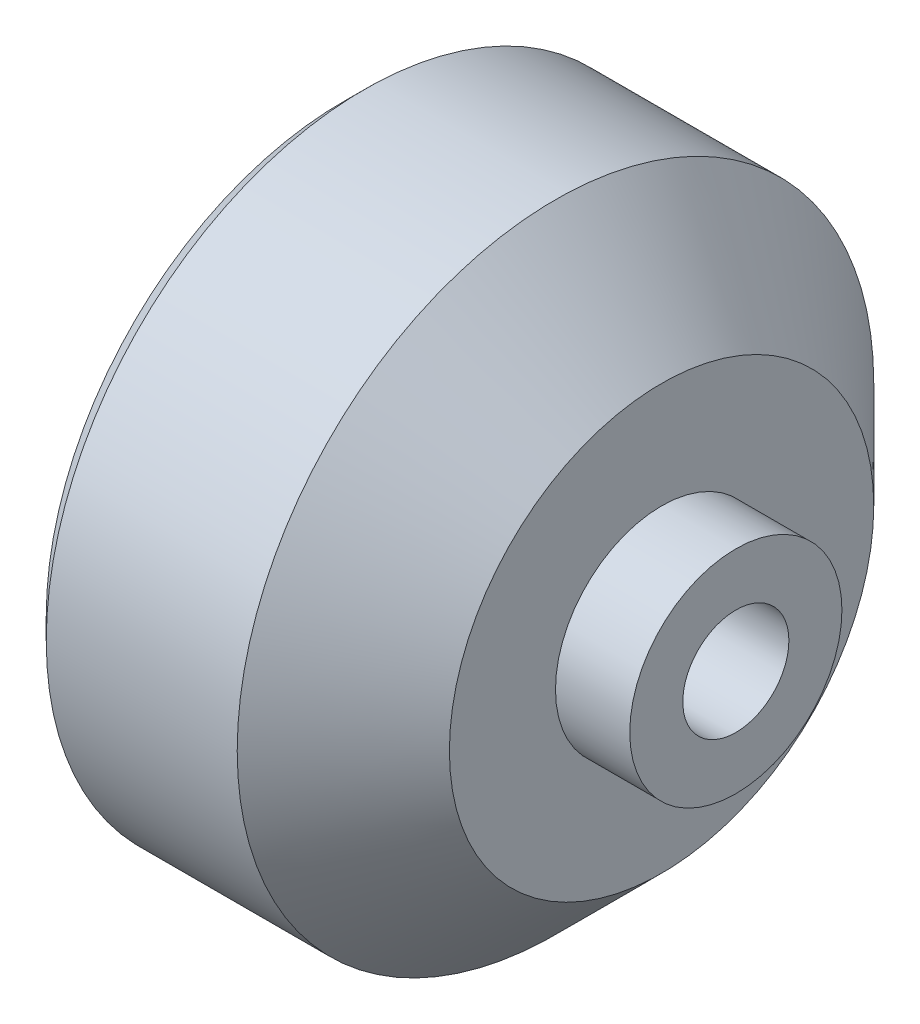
from build123d import *

# Parameters (mm, degrees)
SKETCH2_R          = 2.5
CUT_EXTRUDE1_DEPTH = 29.14693589


with BuildPart() as part:
    # Sketch1 → Revolve1 (revolve)
    with BuildSketch(Plane(origin=(0, 0, 0), x_dir=(1, 0, 0), z_dir=(0, 1, 0)), mode=Mode.PRIVATE) as revolve1_sk:
        Polygon((0, 0), (18.5, 0), (18.5, 5), (15, 5), (15, 10), (10, 15), (1, 15), (0, 14), align=None)
    revolve(revolve1_sk.sketch.rotate(Axis((0, 0, 0), (1, 0, 0)), 180), axis=Axis((0, 0, 0), (1, 0, 0)))

    # Sketch2 → Cut-Extrude1 (cut, through all)
    with BuildSketch(Plane(origin=(18.5, 0, 0), x_dir=(0, 0, -1), z_dir=(1, 0, 0))):
        Circle(SKETCH2_R)
    extrude(amount=-CUT_EXTRUDE1_DEPTH, mode=Mode.SUBTRACT)


solid = part.part
